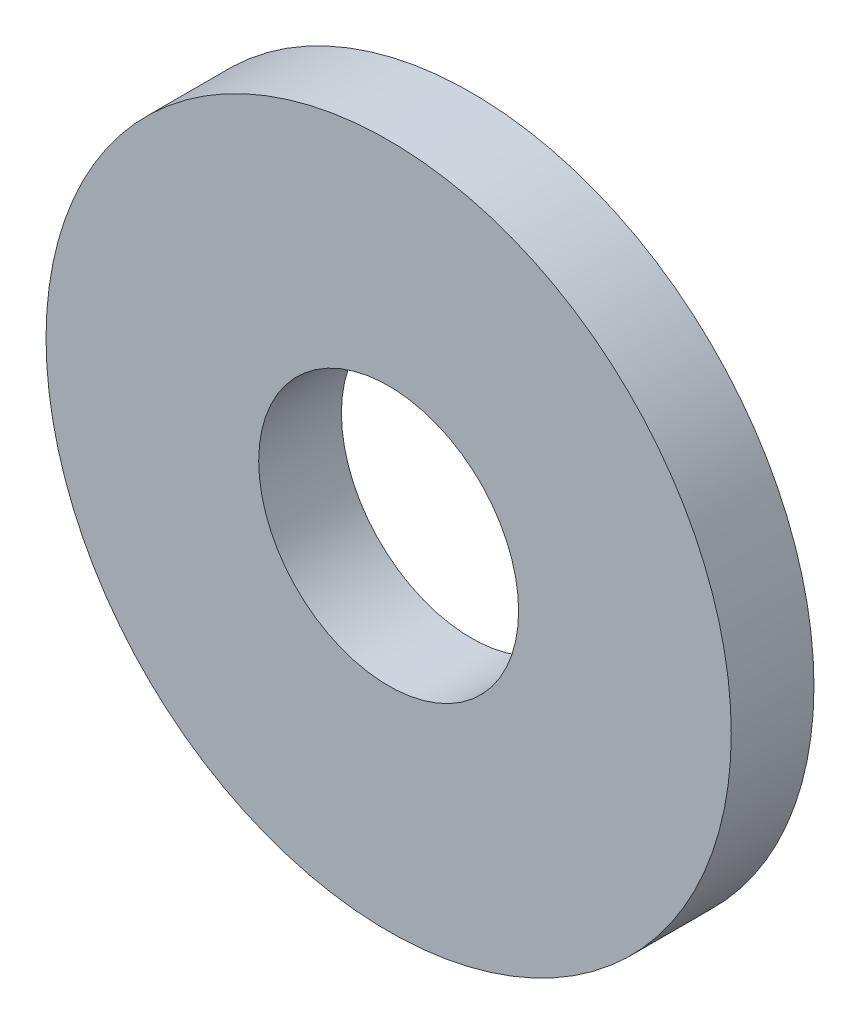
from build123d import *

# Parameters (mm, degrees)
ESQUISSE1_R          = 2.9
ESQUISSE1_R_2        = 1.1
BASE_EXTRUSION_DEPTH = 0.7


with BuildPart() as part:
    # Esquisse1 → Base-Extrusion (new body)
    with BuildSketch(Plane.XY):
        Circle(ESQUISSE1_R)
        Circle(ESQUISSE1_R_2, mode=Mode.SUBTRACT)
    extrude(amount=BASE_EXTRUSION_DEPTH)


solid = part.part
